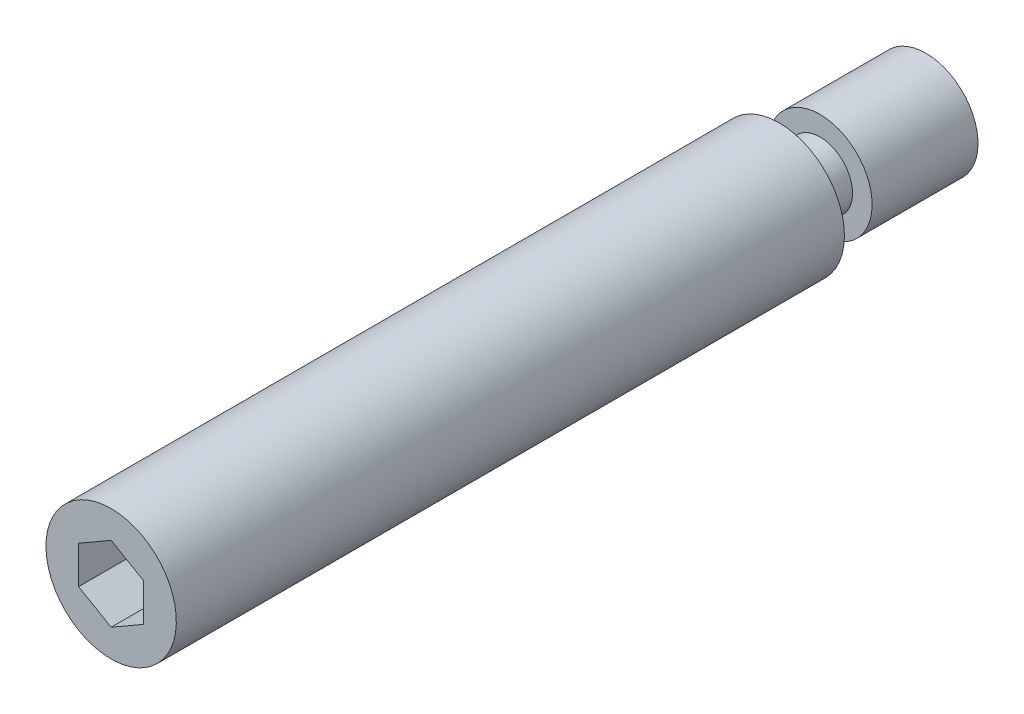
ISO-10303-21;
HEADER;
FILE_DESCRIPTION(('STEP AP214'),'2;1');
FILE_NAME('part.step','',(''),(''),'','','');
FILE_SCHEMA(('AUTOMOTIVE_DESIGN { 1 0 10303 214 1 1 1 1 }'));
ENDSEC;
DATA;
#1=APPLICATION_CONTEXT('core data for automotive mechanical design processes');
#2=APPLICATION_PROTOCOL_DEFINITION('international standard','automotive_design',2000,#1);
#3=PRODUCT_CONTEXT('',#1,'mechanical');
#4=PRODUCT('Part','Part','',(#3));
#5=PRODUCT_RELATED_PRODUCT_CATEGORY('part','',(#4));
#6=PRODUCT_DEFINITION_FORMATION('','',#4);
#7=PRODUCT_DEFINITION_CONTEXT('part definition',#1,'design');
#8=PRODUCT_DEFINITION('design','',#6,#7);
#9=PRODUCT_DEFINITION_SHAPE('','',#8);
#10=(LENGTH_UNIT() NAMED_UNIT(*) SI_UNIT(.MILLI.,.METRE.));
#11=(NAMED_UNIT(*) PLANE_ANGLE_UNIT() SI_UNIT($,.RADIAN.));
#12=(NAMED_UNIT(*) SI_UNIT($,.STERADIAN.) SOLID_ANGLE_UNIT());
#13=UNCERTAINTY_MEASURE_WITH_UNIT(LENGTH_MEASURE(1.E-05),#10,'distance_accuracy_value','');
#14=(GEOMETRIC_REPRESENTATION_CONTEXT(3) GLOBAL_UNCERTAINTY_ASSIGNED_CONTEXT((#13)) GLOBAL_UNIT_ASSIGNED_CONTEXT((#10,
#11,#12)) REPRESENTATION_CONTEXT('',''));
#15=CARTESIAN_POINT('',(0.,0.,0.));
#16=DIRECTION('',(0.,0.,1.));
#17=DIRECTION('',(1.,0.,0.));
#18=AXIS2_PLACEMENT_3D('',#15,#16,#17);
#19=CARTESIAN_POINT('',(0.,-4.,9.));
#20=DIRECTION('',(0.,0.,-1.));
#21=DIRECTION('',(0.,-1.,0.));
#22=AXIS2_PLACEMENT_3D('',#19,#20,#21);
#23=PLANE('',#22);
#24=CARTESIAN_POINT('',(0.,0.,9.));
#25=DIRECTION('',(0.,0.,1.));
#26=DIRECTION('',(0.,1.,0.));
#27=AXIS2_PLACEMENT_3D('',#24,#25,#26);
#28=CIRCLE('',#27,2.);
#29=CARTESIAN_POINT('',(0.,2.,9.));
#30=VERTEX_POINT('',#29);
#31=EDGE_CURVE('E115',#30,#30,#28,.T.);
#32=ORIENTED_EDGE('',*,*,#31,.T.);
#33=EDGE_LOOP('',(#32));
#34=FACE_BOUND('',#33,.T.);
#35=CARTESIAN_POINT('',(0.,0.,9.));
#36=DIRECTION('',(0.,0.,1.));
#37=DIRECTION('',(0.,1.,0.));
#38=AXIS2_PLACEMENT_3D('',#35,#36,#37);
#39=CIRCLE('',#38,4.);
#40=CARTESIAN_POINT('',(0.,4.,9.));
#41=VERTEX_POINT('',#40);
#42=EDGE_CURVE('E9',#41,#41,#39,.T.);
#43=ORIENTED_EDGE('',*,*,#42,.F.);
#44=EDGE_LOOP('',(#43));
#45=FACE_BOUND('',#44,.T.);
#46=ADVANCED_FACE('F14',(#34,#45),#23,.T.);
#47=CARTESIAN_POINT('',(0.,0.,20.));
#48=DIRECTION('',(0.,0.,1.));
#49=DIRECTION('',(0.,1.,0.));
#50=AXIS2_PLACEMENT_3D('',#47,#48,#49);
#51=CYLINDRICAL_SURFACE('',#50,4.);
#52=CARTESIAN_POINT('',(0.,0.,50.));
#53=DIRECTION('',(0.,0.,1.));
#54=DIRECTION('',(0.,1.,0.));
#55=AXIS2_PLACEMENT_3D('',#52,#53,#54);
#56=CIRCLE('',#55,4.);
#57=CARTESIAN_POINT('',(0.,4.,50.));
#58=VERTEX_POINT('',#57);
#59=EDGE_CURVE('E21',#58,#58,#56,.T.);
#60=ORIENTED_EDGE('',*,*,#59,.F.);
#61=EDGE_LOOP('',(#60));
#62=FACE_BOUND('',#61,.T.);
#63=ORIENTED_EDGE('',*,*,#42,.T.);
#64=EDGE_LOOP('',(#63));
#65=FACE_BOUND('',#64,.T.);
#66=ADVANCED_FACE('F136',(#62,#65),#51,.T.);
#67=CARTESIAN_POINT('',(0.,-4.,50.));
#68=DIRECTION('',(0.,0.,-1.));
#69=DIRECTION('',(0.,-1.,0.));
#70=AXIS2_PLACEMENT_3D('',#67,#68,#69);
#71=PLANE('',#70);
#72=DIRECTION('',(-0.866025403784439,-0.5,0.));
#73=VECTOR('',#72,1.);
#74=CARTESIAN_POINT('',(0.,2.30940107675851,50.));
#75=LINE('',#74,#73);
#76=CARTESIAN_POINT('',(0.,2.30940107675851,50.));
#77=VERTEX_POINT('',#76);
#78=CARTESIAN_POINT('',(-2.,1.15470053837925,50.));
#79=VERTEX_POINT('',#78);
#80=EDGE_CURVE('E102',#77,#79,#75,.T.);
#81=ORIENTED_EDGE('',*,*,#80,.F.);
#82=DIRECTION('',(-0.866025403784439,0.5,0.));
#83=VECTOR('',#82,1.);
#84=CARTESIAN_POINT('',(2.,1.15470053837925,50.));
#85=LINE('',#84,#83);
#86=CARTESIAN_POINT('',(2.,1.15470053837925,50.));
#87=VERTEX_POINT('',#86);
#88=EDGE_CURVE('E28',#87,#77,#85,.T.);
#89=ORIENTED_EDGE('',*,*,#88,.F.);
#90=DIRECTION('',(0.,1.,0.));
#91=VECTOR('',#90,1.);
#92=CARTESIAN_POINT('',(2.,-1.15470053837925,50.));
#93=LINE('',#92,#91);
#94=CARTESIAN_POINT('',(2.,-1.15470053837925,50.));
#95=VERTEX_POINT('',#94);
#96=EDGE_CURVE('E111',#95,#87,#93,.T.);
#97=ORIENTED_EDGE('',*,*,#96,.F.);
#98=DIRECTION('',(0.866025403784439,0.5,0.));
#99=VECTOR('',#98,1.);
#100=CARTESIAN_POINT('',(0.,-2.30940107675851,50.));
#101=LINE('',#100,#99);
#102=CARTESIAN_POINT('',(0.,-2.30940107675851,50.));
#103=VERTEX_POINT('',#102);
#104=EDGE_CURVE('E109',#103,#95,#101,.T.);
#105=ORIENTED_EDGE('',*,*,#104,.F.);
#106=DIRECTION('',(0.866025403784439,-0.5,0.));
#107=VECTOR('',#106,1.);
#108=CARTESIAN_POINT('',(-2.,-1.15470053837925,50.));
#109=LINE('',#108,#107);
#110=CARTESIAN_POINT('',(-2.,-1.15470053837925,50.));
#111=VERTEX_POINT('',#110);
#112=EDGE_CURVE('E76',#111,#103,#109,.T.);
#113=ORIENTED_EDGE('',*,*,#112,.F.);
#114=DIRECTION('',(0.,-1.,0.));
#115=VECTOR('',#114,1.);
#116=CARTESIAN_POINT('',(-2.,1.15470053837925,50.));
#117=LINE('',#116,#115);
#118=EDGE_CURVE('E105',#79,#111,#117,.T.);
#119=ORIENTED_EDGE('',*,*,#118,.F.);
#120=EDGE_LOOP('',(#81,#89,#97,#105,#113,#119));
#121=FACE_BOUND('',#120,.T.);
#122=ORIENTED_EDGE('',*,*,#59,.T.);
#123=EDGE_LOOP('',(#122));
#124=FACE_BOUND('',#123,.T.);
#125=ADVANCED_FACE('F134',(#121,#124),#71,.F.);
#126=CARTESIAN_POINT('',(0.,-3.2,0.));
#127=DIRECTION('',(0.,0.,-1.));
#128=DIRECTION('',(0.,-1.,0.));
#129=AXIS2_PLACEMENT_3D('',#126,#127,#128);
#130=PLANE('',#129);
#131=CARTESIAN_POINT('',(0.,0.,0.));
#132=DIRECTION('',(0.,0.,1.));
#133=DIRECTION('',(0.,1.,0.));
#134=AXIS2_PLACEMENT_3D('',#131,#132,#133);
#135=CIRCLE('',#134,3.2);
#136=CARTESIAN_POINT('',(0.,3.2,0.));
#137=VERTEX_POINT('',#136);
#138=EDGE_CURVE('E129',#137,#137,#135,.T.);
#139=ORIENTED_EDGE('',*,*,#138,.F.);
#140=EDGE_LOOP('',(#139));
#141=FACE_BOUND('',#140,.T.);
#142=ADVANCED_FACE('F167',(#141),#130,.T.);
#143=CARTESIAN_POINT('',(0.,0.,20.));
#144=DIRECTION('',(0.,0.,1.));
#145=DIRECTION('',(0.,1.,0.));
#146=AXIS2_PLACEMENT_3D('',#143,#144,#145);
#147=CYLINDRICAL_SURFACE('',#146,3.2);
#148=ORIENTED_EDGE('',*,*,#138,.T.);
#149=EDGE_LOOP('',(#148));
#150=FACE_BOUND('',#149,.T.);
#151=CARTESIAN_POINT('',(0.,0.,6.5));
#152=DIRECTION('',(0.,0.,1.));
#153=DIRECTION('',(0.,1.,0.));
#154=AXIS2_PLACEMENT_3D('',#151,#152,#153);
#155=CIRCLE('',#154,3.2);
#156=CARTESIAN_POINT('',(0.,3.2,6.5));
#157=VERTEX_POINT('',#156);
#158=EDGE_CURVE('E126',#157,#157,#155,.T.);
#159=ORIENTED_EDGE('',*,*,#158,.F.);
#160=EDGE_LOOP('',(#159));
#161=FACE_BOUND('',#160,.T.);
#162=ADVANCED_FACE('F160',(#150,#161),#147,.T.);
#163=CARTESIAN_POINT('',(0.,-2.,6.5));
#164=DIRECTION('',(0.,0.,1.));
#165=DIRECTION('',(0.,1.,0.));
#166=AXIS2_PLACEMENT_3D('',#163,#164,#165);
#167=PLANE('',#166);
#168=ORIENTED_EDGE('',*,*,#158,.T.);
#169=EDGE_LOOP('',(#168));
#170=FACE_BOUND('',#169,.T.);
#171=CARTESIAN_POINT('',(0.,0.,6.5));
#172=DIRECTION('',(0.,0.,1.));
#173=DIRECTION('',(0.,1.,0.));
#174=AXIS2_PLACEMENT_3D('',#171,#172,#173);
#175=CIRCLE('',#174,2.);
#176=CARTESIAN_POINT('',(0.,2.,6.5));
#177=VERTEX_POINT('',#176);
#178=EDGE_CURVE('E123',#177,#177,#175,.T.);
#179=ORIENTED_EDGE('',*,*,#178,.F.);
#180=EDGE_LOOP('',(#179));
#181=FACE_BOUND('',#180,.T.);
#182=ADVANCED_FACE('F151',(#170,#181),#167,.T.);
#183=CARTESIAN_POINT('',(0.,0.,20.));
#184=DIRECTION('',(0.,0.,1.));
#185=DIRECTION('',(0.,1.,0.));
#186=AXIS2_PLACEMENT_3D('',#183,#184,#185);
#187=CYLINDRICAL_SURFACE('',#186,2.);
#188=ORIENTED_EDGE('',*,*,#178,.T.);
#189=EDGE_LOOP('',(#188));
#190=FACE_BOUND('',#189,.T.);
#191=ORIENTED_EDGE('',*,*,#31,.F.);
#192=EDGE_LOOP('',(#191));
#193=FACE_BOUND('',#192,.T.);
#194=ADVANCED_FACE('F148',(#190,#193),#187,.T.);
#195=CARTESIAN_POINT('',(2.,1.15470053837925,45.));
#196=DIRECTION('',(0.5,0.866025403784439,0.));
#197=DIRECTION('',(-0.866025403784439,0.5,0.));
#198=AXIS2_PLACEMENT_3D('',#195,#196,#197);
#199=PLANE('',#198);
#200=ORIENTED_EDGE('',*,*,#88,.T.);
#201=DIRECTION('',(0.,0.,1.));
#202=VECTOR('',#201,1.);
#203=CARTESIAN_POINT('',(0.,2.30940107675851,45.));
#204=LINE('',#203,#202);
#205=CARTESIAN_POINT('',(0.,2.30940107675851,45.));
#206=VERTEX_POINT('',#205);
#207=EDGE_CURVE('E58',#206,#77,#204,.T.);
#208=ORIENTED_EDGE('',*,*,#207,.F.);
#209=DIRECTION('',(-0.866025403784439,0.5,0.));
#210=VECTOR('',#209,1.);
#211=CARTESIAN_POINT('',(2.,1.15470053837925,45.));
#212=LINE('',#211,#210);
#213=CARTESIAN_POINT('',(2.,1.15470053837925,45.));
#214=VERTEX_POINT('',#213);
#215=EDGE_CURVE('E113',#214,#206,#212,.T.);
#216=ORIENTED_EDGE('',*,*,#215,.F.);
#217=DIRECTION('',(0.,0.,1.));
#218=VECTOR('',#217,1.);
#219=CARTESIAN_POINT('',(2.,1.15470053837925,45.));
#220=LINE('',#219,#218);
#221=EDGE_CURVE('E36',#214,#87,#220,.T.);
#222=ORIENTED_EDGE('',*,*,#221,.T.);
#223=EDGE_LOOP('',(#200,#208,#216,#222));
#224=FACE_BOUND('',#223,.T.);
#225=ADVANCED_FACE('F150',(#224),#199,.F.);
#226=CARTESIAN_POINT('',(2.,-1.15470053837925,45.));
#227=DIRECTION('',(1.,0.,0.));
#228=DIRECTION('',(0.,0.,-1.));
#229=AXIS2_PLACEMENT_3D('',#226,#227,#228);
#230=PLANE('',#229);
#231=ORIENTED_EDGE('',*,*,#96,.T.);
#232=ORIENTED_EDGE('',*,*,#221,.F.);
#233=DIRECTION('',(0.,1.,0.));
#234=VECTOR('',#233,1.);
#235=CARTESIAN_POINT('',(2.,-1.15470053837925,45.));
#236=LINE('',#235,#234);
#237=CARTESIAN_POINT('',(2.,-1.15470053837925,45.));
#238=VERTEX_POINT('',#237);
#239=EDGE_CURVE('E88',#238,#214,#236,.T.);
#240=ORIENTED_EDGE('',*,*,#239,.F.);
#241=DIRECTION('',(0.,0.,1.));
#242=VECTOR('',#241,1.);
#243=CARTESIAN_POINT('',(2.,-1.15470053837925,45.));
#244=LINE('',#243,#242);
#245=EDGE_CURVE('E80',#238,#95,#244,.T.);
#246=ORIENTED_EDGE('',*,*,#245,.T.);
#247=EDGE_LOOP('',(#231,#232,#240,#246));
#248=FACE_BOUND('',#247,.T.);
#249=ADVANCED_FACE('F158',(#248),#230,.F.);
#250=CARTESIAN_POINT('',(0.,-2.30940107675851,45.));
#251=DIRECTION('',(0.5,-0.866025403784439,0.));
#252=DIRECTION('',(0.866025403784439,0.5,0.));
#253=AXIS2_PLACEMENT_3D('',#250,#251,#252);
#254=PLANE('',#253);
#255=ORIENTED_EDGE('',*,*,#104,.T.);
#256=ORIENTED_EDGE('',*,*,#245,.F.);
#257=DIRECTION('',(0.866025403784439,0.5,0.));
#258=VECTOR('',#257,1.);
#259=CARTESIAN_POINT('',(0.,-2.30940107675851,45.));
#260=LINE('',#259,#258);
#261=CARTESIAN_POINT('',(0.,-2.30940107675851,45.));
#262=VERTEX_POINT('',#261);
#263=EDGE_CURVE('E84',#262,#238,#260,.T.);
#264=ORIENTED_EDGE('',*,*,#263,.F.);
#265=DIRECTION('',(0.,0.,1.));
#266=VECTOR('',#265,1.);
#267=CARTESIAN_POINT('',(0.,-2.30940107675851,45.));
#268=LINE('',#267,#266);
#269=EDGE_CURVE('E69',#262,#103,#268,.T.);
#270=ORIENTED_EDGE('',*,*,#269,.T.);
#271=EDGE_LOOP('',(#255,#256,#264,#270));
#272=FACE_BOUND('',#271,.T.);
#273=ADVANCED_FACE('F85',(#272),#254,.F.);
#274=CARTESIAN_POINT('',(-2.,-1.15470053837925,45.));
#275=DIRECTION('',(-0.5,-0.866025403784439,0.));
#276=DIRECTION('',(0.866025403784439,-0.5,0.));
#277=AXIS2_PLACEMENT_3D('',#274,#275,#276);
#278=PLANE('',#277);
#279=ORIENTED_EDGE('',*,*,#112,.T.);
#280=ORIENTED_EDGE('',*,*,#269,.F.);
#281=DIRECTION('',(0.866025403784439,-0.5,0.));
#282=VECTOR('',#281,1.);
#283=CARTESIAN_POINT('',(-2.,-1.15470053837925,45.));
#284=LINE('',#283,#282);
#285=CARTESIAN_POINT('',(-2.,-1.15470053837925,45.));
#286=VERTEX_POINT('',#285);
#287=EDGE_CURVE('E73',#286,#262,#284,.T.);
#288=ORIENTED_EDGE('',*,*,#287,.F.);
#289=DIRECTION('',(0.,0.,1.));
#290=VECTOR('',#289,1.);
#291=CARTESIAN_POINT('',(-2.,-1.15470053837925,45.));
#292=LINE('',#291,#290);
#293=EDGE_CURVE('E81',#286,#111,#292,.T.);
#294=ORIENTED_EDGE('',*,*,#293,.T.);
#295=EDGE_LOOP('',(#279,#280,#288,#294));
#296=FACE_BOUND('',#295,.T.);
#297=ADVANCED_FACE('F71',(#296),#278,.F.);
#298=CARTESIAN_POINT('',(-2.,1.15470053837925,45.));
#299=DIRECTION('',(-1.,0.,0.));
#300=DIRECTION('',(0.,0.,1.));
#301=AXIS2_PLACEMENT_3D('',#298,#299,#300);
#302=PLANE('',#301);
#303=ORIENTED_EDGE('',*,*,#118,.T.);
#304=ORIENTED_EDGE('',*,*,#293,.F.);
#305=DIRECTION('',(0.,-1.,0.));
#306=VECTOR('',#305,1.);
#307=CARTESIAN_POINT('',(-2.,1.15470053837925,45.));
#308=LINE('',#307,#306);
#309=CARTESIAN_POINT('',(-2.,1.15470053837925,45.));
#310=VERTEX_POINT('',#309);
#311=EDGE_CURVE('E94',#310,#286,#308,.T.);
#312=ORIENTED_EDGE('',*,*,#311,.F.);
#313=DIRECTION('',(0.,0.,1.));
#314=VECTOR('',#313,1.);
#315=CARTESIAN_POINT('',(-2.,1.15470053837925,45.));
#316=LINE('',#315,#314);
#317=EDGE_CURVE('E118',#310,#79,#316,.T.);
#318=ORIENTED_EDGE('',*,*,#317,.T.);
#319=EDGE_LOOP('',(#303,#304,#312,#318));
#320=FACE_BOUND('',#319,.T.);
#321=ADVANCED_FACE('F192',(#320),#302,.F.);
#322=CARTESIAN_POINT('',(0.,2.30940107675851,45.));
#323=DIRECTION('',(-0.5,0.866025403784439,0.));
#324=DIRECTION('',(-0.866025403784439,-0.5,0.));
#325=AXIS2_PLACEMENT_3D('',#322,#323,#324);
#326=PLANE('',#325);
#327=ORIENTED_EDGE('',*,*,#80,.T.);
#328=ORIENTED_EDGE('',*,*,#317,.F.);
#329=DIRECTION('',(-0.866025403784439,-0.5,0.));
#330=VECTOR('',#329,1.);
#331=CARTESIAN_POINT('',(0.,2.30940107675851,45.));
#332=LINE('',#331,#330);
#333=EDGE_CURVE('E96',#206,#310,#332,.T.);
#334=ORIENTED_EDGE('',*,*,#333,.F.);
#335=ORIENTED_EDGE('',*,*,#207,.T.);
#336=EDGE_LOOP('',(#327,#328,#334,#335));
#337=FACE_BOUND('',#336,.T.);
#338=ADVANCED_FACE('F180',(#337),#326,.F.);
#339=CARTESIAN_POINT('',(0.,2.30940107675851,45.));
#340=DIRECTION('',(0.,0.,1.));
#341=DIRECTION('',(1.,0.,0.));
#342=AXIS2_PLACEMENT_3D('',#339,#340,#341);
#343=PLANE('',#342);
#344=ORIENTED_EDGE('',*,*,#215,.T.);
#345=ORIENTED_EDGE('',*,*,#333,.T.);
#346=ORIENTED_EDGE('',*,*,#311,.T.);
#347=ORIENTED_EDGE('',*,*,#287,.T.);
#348=ORIENTED_EDGE('',*,*,#263,.T.);
#349=ORIENTED_EDGE('',*,*,#239,.T.);
#350=EDGE_LOOP('',(#344,#345,#346,#347,#348,#349));
#351=FACE_BOUND('',#350,.T.);
#352=ADVANCED_FACE('F91',(#351),#343,.T.);
#353=CLOSED_SHELL('',(#46,#66,#125,#142,#162,#182,#194,#225,#249,#273,#297,#321,#338,#352));
#354=MANIFOLD_SOLID_BREP('B1',#353);
#355=ADVANCED_BREP_SHAPE_REPRESENTATION('',(#18,#354),#14);
#356=SHAPE_DEFINITION_REPRESENTATION(#9,#355);
ENDSEC;
END-ISO-10303-21;
